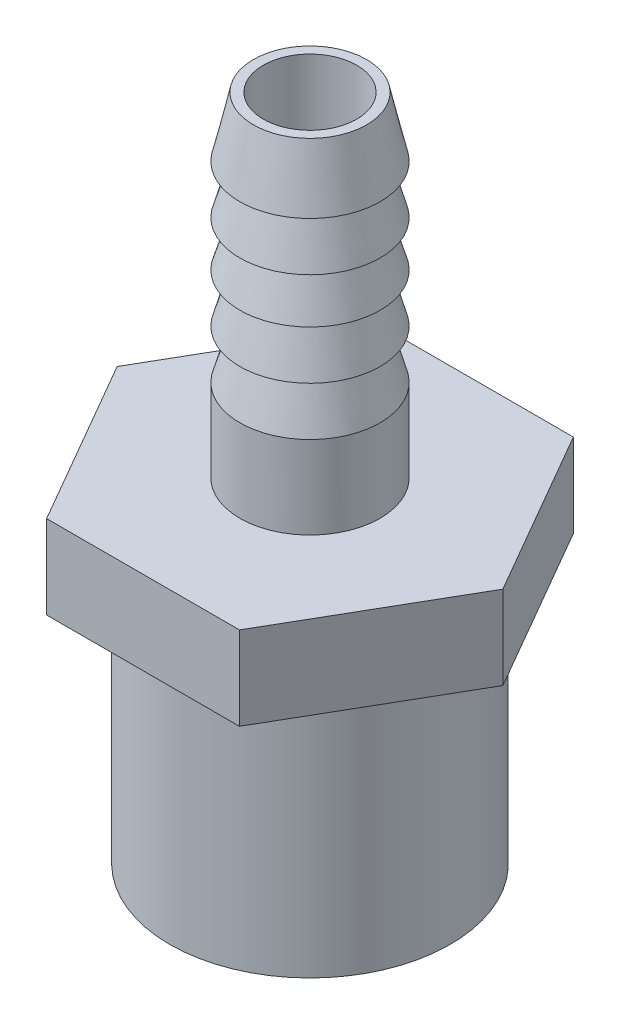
ISO-10303-21;
HEADER;
FILE_DESCRIPTION(('STEP AP214'),'2;1');
FILE_NAME('part.step','',(''),(''),'','','');
FILE_SCHEMA(('AUTOMOTIVE_DESIGN { 1 0 10303 214 1 1 1 1 }'));
ENDSEC;
DATA;
#1=APPLICATION_CONTEXT('core data for automotive mechanical design processes');
#2=APPLICATION_PROTOCOL_DEFINITION('international standard','automotive_design',2000,#1);
#3=PRODUCT_CONTEXT('',#1,'mechanical');
#4=PRODUCT('Part','Part','',(#3));
#5=PRODUCT_RELATED_PRODUCT_CATEGORY('part','',(#4));
#6=PRODUCT_DEFINITION_FORMATION('','',#4);
#7=PRODUCT_DEFINITION_CONTEXT('part definition',#1,'design');
#8=PRODUCT_DEFINITION('design','',#6,#7);
#9=PRODUCT_DEFINITION_SHAPE('','',#8);
#10=(LENGTH_UNIT() NAMED_UNIT(*) SI_UNIT(.MILLI.,.METRE.));
#11=(NAMED_UNIT(*) PLANE_ANGLE_UNIT() SI_UNIT($,.RADIAN.));
#12=(NAMED_UNIT(*) SI_UNIT($,.STERADIAN.) SOLID_ANGLE_UNIT());
#13=UNCERTAINTY_MEASURE_WITH_UNIT(LENGTH_MEASURE(1.E-05),#10,'distance_accuracy_value','');
#14=(GEOMETRIC_REPRESENTATION_CONTEXT(3) GLOBAL_UNCERTAINTY_ASSIGNED_CONTEXT((#13)) GLOBAL_UNIT_ASSIGNED_CONTEXT((#10,
#11,#12)) REPRESENTATION_CONTEXT('',''));
#15=CARTESIAN_POINT('',(0.,0.,0.));
#16=DIRECTION('',(0.,0.,1.));
#17=DIRECTION('',(1.,0.,0.));
#18=AXIS2_PLACEMENT_3D('',#15,#16,#17);
#19=CARTESIAN_POINT('',(-14.6646966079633,6.35,0.00259417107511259));
#20=DIRECTION('',(0.865936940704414,0.,-0.50015319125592));
#21=DIRECTION('',(-0.50015319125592,0.,-0.865936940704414));
#22=AXIS2_PLACEMENT_3D('',#19,#20,#21);
#23=PLANE('',#22);
#24=DIRECTION('',(0.50015319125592,0.,0.865936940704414));
#25=VECTOR('',#24,1.);
#26=CARTESIAN_POINT('',(-14.6646966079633,0.,0.00259417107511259));
#27=LINE('',#26,#25);
#28=CARTESIAN_POINT('',(-14.6646966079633,0.,0.00259417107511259));
#29=VERTEX_POINT('',#28);
#30=CARTESIAN_POINT('',(-7.33010168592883,0.,12.7012968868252));
#31=VERTEX_POINT('',#30);
#32=EDGE_CURVE('E119',#29,#31,#27,.T.);
#33=ORIENTED_EDGE('',*,*,#32,.T.);
#34=DIRECTION('',(0.,-1.,0.));
#35=VECTOR('',#34,1.);
#36=CARTESIAN_POINT('',(-7.33010168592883,6.35,12.7012968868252));
#37=LINE('',#36,#35);
#38=CARTESIAN_POINT('',(-7.33010168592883,6.35,12.7012968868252));
#39=VERTEX_POINT('',#38);
#40=EDGE_CURVE('E137',#39,#31,#37,.T.);
#41=ORIENTED_EDGE('',*,*,#40,.F.);
#42=DIRECTION('',(0.50015319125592,0.,0.865936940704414));
#43=VECTOR('',#42,1.);
#44=CARTESIAN_POINT('',(-14.6646966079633,6.35,0.00259417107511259));
#45=LINE('',#44,#43);
#46=CARTESIAN_POINT('',(-14.6646966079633,6.35,0.00259417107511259));
#47=VERTEX_POINT('',#46);
#48=EDGE_CURVE('E130',#47,#39,#45,.T.);
#49=ORIENTED_EDGE('',*,*,#48,.F.);
#50=DIRECTION('',(0.,-1.,0.));
#51=VECTOR('',#50,1.);
#52=CARTESIAN_POINT('',(-14.6646966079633,6.35,0.00259417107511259));
#53=LINE('',#52,#51);
#54=EDGE_CURVE('E115',#47,#29,#53,.T.);
#55=ORIENTED_EDGE('',*,*,#54,.T.);
#56=EDGE_LOOP('',(#33,#41,#49,#55));
#57=FACE_BOUND('',#56,.T.);
#58=ADVANCED_FACE('F34',(#57),#23,.F.);
#59=CARTESIAN_POINT('',(-7.33010168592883,6.35,12.7012968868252));
#60=DIRECTION('',(-0.000176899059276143,0.,-0.999999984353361));
#61=DIRECTION('',(-0.999999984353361,0.,0.000176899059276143));
#62=AXIS2_PLACEMENT_3D('',#59,#60,#61);
#63=PLANE('',#62);
#64=DIRECTION('',(0.999999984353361,0.,-0.000176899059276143));
#65=VECTOR('',#64,1.);
#66=CARTESIAN_POINT('',(-7.33010168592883,0.,12.7012968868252));
#67=LINE('',#66,#65);
#68=CARTESIAN_POINT('',(7.33459492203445,0.,12.6987027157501));
#69=VERTEX_POINT('',#68);
#70=EDGE_CURVE('E122',#31,#69,#67,.T.);
#71=ORIENTED_EDGE('',*,*,#70,.T.);
#72=DIRECTION('',(0.,-1.,0.));
#73=VECTOR('',#72,1.);
#74=CARTESIAN_POINT('',(7.33459492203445,6.35,12.6987027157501));
#75=LINE('',#74,#73);
#76=CARTESIAN_POINT('',(7.33459492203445,6.35,12.6987027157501));
#77=VERTEX_POINT('',#76);
#78=EDGE_CURVE('E134',#77,#69,#75,.T.);
#79=ORIENTED_EDGE('',*,*,#78,.F.);
#80=DIRECTION('',(0.999999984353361,0.,-0.000176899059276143));
#81=VECTOR('',#80,1.);
#82=CARTESIAN_POINT('',(-7.33010168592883,6.35,12.7012968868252));
#83=LINE('',#82,#81);
#84=EDGE_CURVE('E88',#39,#77,#83,.T.);
#85=ORIENTED_EDGE('',*,*,#84,.F.);
#86=ORIENTED_EDGE('',*,*,#40,.T.);
#87=EDGE_LOOP('',(#71,#79,#85,#86));
#88=FACE_BOUND('',#87,.T.);
#89=ADVANCED_FACE('F169',(#88),#63,.F.);
#90=CARTESIAN_POINT('',(7.33459492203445,6.35,12.6987027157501));
#91=DIRECTION('',(-0.86611383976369,0.,-0.499846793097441));
#92=DIRECTION('',(-0.499846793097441,0.,0.866113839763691));
#93=AXIS2_PLACEMENT_3D('',#90,#91,#92);
#94=PLANE('',#93);
#95=DIRECTION('',(0.499846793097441,0.,-0.86611383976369));
#96=VECTOR('',#95,1.);
#97=CARTESIAN_POINT('',(7.33459492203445,0.,12.6987027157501));
#98=LINE('',#97,#96);
#99=CARTESIAN_POINT('',(14.6646966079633,0.,-0.00259417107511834));
#100=VERTEX_POINT('',#99);
#101=EDGE_CURVE('E125',#69,#100,#98,.T.);
#102=ORIENTED_EDGE('',*,*,#101,.T.);
#103=DIRECTION('',(0.,-1.,0.));
#104=VECTOR('',#103,1.);
#105=CARTESIAN_POINT('',(14.6646966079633,6.35,-0.00259417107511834));
#106=LINE('',#105,#104);
#107=CARTESIAN_POINT('',(14.6646966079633,6.35,-0.00259417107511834));
#108=VERTEX_POINT('',#107);
#109=EDGE_CURVE('E110',#108,#100,#106,.T.);
#110=ORIENTED_EDGE('',*,*,#109,.F.);
#111=DIRECTION('',(0.499846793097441,0.,-0.86611383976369));
#112=VECTOR('',#111,1.);
#113=CARTESIAN_POINT('',(7.33459492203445,6.35,12.6987027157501));
#114=LINE('',#113,#112);
#115=EDGE_CURVE('E101',#77,#108,#114,.T.);
#116=ORIENTED_EDGE('',*,*,#115,.F.);
#117=ORIENTED_EDGE('',*,*,#78,.T.);
#118=EDGE_LOOP('',(#102,#110,#116,#117));
#119=FACE_BOUND('',#118,.T.);
#120=ADVANCED_FACE('F174',(#119),#94,.F.);
#121=CARTESIAN_POINT('',(14.6646966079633,6.35,-0.00259417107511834));
#122=DIRECTION('',(-0.865936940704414,0.,0.50015319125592));
#123=DIRECTION('',(0.50015319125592,0.,0.865936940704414));
#124=AXIS2_PLACEMENT_3D('',#121,#122,#123);
#125=PLANE('',#124);
#126=DIRECTION('',(-0.50015319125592,0.,-0.865936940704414));
#127=VECTOR('',#126,1.);
#128=CARTESIAN_POINT('',(14.6646966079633,0.,-0.00259417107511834));
#129=LINE('',#128,#127);
#130=CARTESIAN_POINT('',(7.33010168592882,0.,-12.7012968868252));
#131=VERTEX_POINT('',#130);
#132=EDGE_CURVE('E109',#100,#131,#129,.T.);
#133=ORIENTED_EDGE('',*,*,#132,.T.);
#134=DIRECTION('',(0.,-1.,0.));
#135=VECTOR('',#134,1.);
#136=CARTESIAN_POINT('',(7.33010168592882,6.35,-12.7012968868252));
#137=LINE('',#136,#135);
#138=CARTESIAN_POINT('',(7.33010168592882,6.35,-12.7012968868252));
#139=VERTEX_POINT('',#138);
#140=EDGE_CURVE('E106',#139,#131,#137,.T.);
#141=ORIENTED_EDGE('',*,*,#140,.F.);
#142=DIRECTION('',(-0.50015319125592,0.,-0.865936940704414));
#143=VECTOR('',#142,1.);
#144=CARTESIAN_POINT('',(14.6646966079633,6.35,-0.00259417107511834));
#145=LINE('',#144,#143);
#146=EDGE_CURVE('E95',#108,#139,#145,.T.);
#147=ORIENTED_EDGE('',*,*,#146,.F.);
#148=ORIENTED_EDGE('',*,*,#109,.T.);
#149=EDGE_LOOP('',(#133,#141,#147,#148));
#150=FACE_BOUND('',#149,.T.);
#151=ADVANCED_FACE('F107',(#150),#125,.F.);
#152=CARTESIAN_POINT('',(7.33010168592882,6.35,-12.7012968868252));
#153=DIRECTION('',(0.000176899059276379,0.,0.999999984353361));
#154=DIRECTION('',(0.999999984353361,0.,-0.000176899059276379));
#155=AXIS2_PLACEMENT_3D('',#152,#153,#154);
#156=PLANE('',#155);
#157=DIRECTION('',(-0.999999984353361,0.,0.000176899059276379));
#158=VECTOR('',#157,1.);
#159=CARTESIAN_POINT('',(7.33010168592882,0.,-12.7012968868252));
#160=LINE('',#159,#158);
#161=CARTESIAN_POINT('',(-7.33459492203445,0.,-12.6987027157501));
#162=VERTEX_POINT('',#161);
#163=EDGE_CURVE('E73',#131,#162,#160,.T.);
#164=ORIENTED_EDGE('',*,*,#163,.T.);
#165=DIRECTION('',(0.,-1.,0.));
#166=VECTOR('',#165,1.);
#167=CARTESIAN_POINT('',(-7.33459492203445,6.35,-12.6987027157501));
#168=LINE('',#167,#166);
#169=CARTESIAN_POINT('',(-7.33459492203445,6.35,-12.6987027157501));
#170=VERTEX_POINT('',#169);
#171=EDGE_CURVE('E111',#170,#162,#168,.T.);
#172=ORIENTED_EDGE('',*,*,#171,.F.);
#173=DIRECTION('',(-0.999999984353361,0.,0.000176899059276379));
#174=VECTOR('',#173,1.);
#175=CARTESIAN_POINT('',(7.33010168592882,6.35,-12.7012968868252));
#176=LINE('',#175,#174);
#177=EDGE_CURVE('E99',#139,#170,#176,.T.);
#178=ORIENTED_EDGE('',*,*,#177,.F.);
#179=ORIENTED_EDGE('',*,*,#140,.T.);
#180=EDGE_LOOP('',(#164,#172,#178,#179));
#181=FACE_BOUND('',#180,.T.);
#182=ADVANCED_FACE('F113',(#181),#156,.F.);
#183=CARTESIAN_POINT('',(-7.33459492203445,6.35,-12.6987027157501));
#184=DIRECTION('',(0.86611383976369,0.,0.499846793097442));
#185=DIRECTION('',(0.499846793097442,0.,-0.86611383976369));
#186=AXIS2_PLACEMENT_3D('',#183,#184,#185);
#187=PLANE('',#186);
#188=DIRECTION('',(-0.499846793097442,0.,0.86611383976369));
#189=VECTOR('',#188,1.);
#190=CARTESIAN_POINT('',(-7.33459492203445,0.,-12.6987027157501));
#191=LINE('',#190,#189);
#192=EDGE_CURVE('E79',#162,#29,#191,.T.);
#193=ORIENTED_EDGE('',*,*,#192,.T.);
#194=ORIENTED_EDGE('',*,*,#54,.F.);
#195=DIRECTION('',(-0.499846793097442,0.,0.86611383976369));
#196=VECTOR('',#195,1.);
#197=CARTESIAN_POINT('',(-7.33459492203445,6.35,-12.6987027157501));
#198=LINE('',#197,#196);
#199=EDGE_CURVE('E50',#170,#47,#198,.T.);
#200=ORIENTED_EDGE('',*,*,#199,.F.);
#201=ORIENTED_EDGE('',*,*,#171,.T.);
#202=EDGE_LOOP('',(#193,#194,#200,#201));
#203=FACE_BOUND('',#202,.T.);
#204=ADVANCED_FACE('F166',(#203),#187,.F.);
#205=CARTESIAN_POINT('',(0.,6.35,0.));
#206=DIRECTION('',(0.,1.,0.));
#207=DIRECTION('',(0.,0.,1.));
#208=AXIS2_PLACEMENT_3D('',#205,#206,#207);
#209=PLANE('',#208);
#210=CARTESIAN_POINT('',(0.,6.35,0.));
#211=DIRECTION('',(0.,1.,0.));
#212=DIRECTION('',(0.,0.,1.));
#213=AXIS2_PLACEMENT_3D('',#210,#211,#212);
#214=CIRCLE('',#213,5.334);
#215=CARTESIAN_POINT('',(0.,6.35,5.334));
#216=VERTEX_POINT('',#215);
#217=EDGE_CURVE('E139',#216,#216,#214,.T.);
#218=ORIENTED_EDGE('',*,*,#217,.F.);
#219=EDGE_LOOP('',(#218));
#220=FACE_BOUND('',#219,.T.);
#221=ORIENTED_EDGE('',*,*,#48,.T.);
#222=ORIENTED_EDGE('',*,*,#84,.T.);
#223=ORIENTED_EDGE('',*,*,#115,.T.);
#224=ORIENTED_EDGE('',*,*,#146,.T.);
#225=ORIENTED_EDGE('',*,*,#177,.T.);
#226=ORIENTED_EDGE('',*,*,#199,.T.);
#227=EDGE_LOOP('',(#221,#222,#223,#224,#225,#226));
#228=FACE_BOUND('',#227,.T.);
#229=ADVANCED_FACE('F97',(#220,#228),#209,.T.);
#230=CARTESIAN_POINT('',(0.,0.,0.));
#231=DIRECTION('',(0.,1.,0.));
#232=DIRECTION('',(0.,0.,1.));
#233=AXIS2_PLACEMENT_3D('',#230,#231,#232);
#234=PLANE('',#233);
#235=CARTESIAN_POINT('',(0.,0.,0.));
#236=DIRECTION('',(0.,1.,0.));
#237=DIRECTION('',(0.,0.,1.));
#238=AXIS2_PLACEMENT_3D('',#235,#236,#237);
#239=CIRCLE('',#238,10.668);
#240=CARTESIAN_POINT('',(0.,0.,10.668));
#241=VERTEX_POINT('',#240);
#242=EDGE_CURVE('E11',#241,#241,#239,.F.);
#243=ORIENTED_EDGE('',*,*,#242,.F.);
#244=EDGE_LOOP('',(#243));
#245=FACE_BOUND('',#244,.T.);
#246=ORIENTED_EDGE('',*,*,#32,.F.);
#247=ORIENTED_EDGE('',*,*,#192,.F.);
#248=ORIENTED_EDGE('',*,*,#163,.F.);
#249=ORIENTED_EDGE('',*,*,#132,.F.);
#250=ORIENTED_EDGE('',*,*,#101,.F.);
#251=ORIENTED_EDGE('',*,*,#70,.F.);
#252=EDGE_LOOP('',(#246,#247,#248,#249,#250,#251));
#253=FACE_BOUND('',#252,.T.);
#254=ADVANCED_FACE('F165',(#245,#253),#234,.F.);
#255=CARTESIAN_POINT('',(0.,-18.5582568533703,0.));
#256=DIRECTION('',(0.,-1.,0.));
#257=DIRECTION('',(0.,0.,-1.));
#258=AXIS2_PLACEMENT_3D('',#255,#256,#257);
#259=CYLINDRICAL_SURFACE('',#258,3.556);
#260=CARTESIAN_POINT('',(0.,6.35,0.));
#261=DIRECTION('',(0.,1.,0.));
#262=DIRECTION('',(0.,0.,1.));
#263=AXIS2_PLACEMENT_3D('',#260,#261,#262);
#264=CIRCLE('',#263,3.556);
#265=CARTESIAN_POINT('',(0.,6.35,3.556));
#266=VERTEX_POINT('',#265);
#267=EDGE_CURVE('E42',#266,#266,#264,.F.);
#268=ORIENTED_EDGE('',*,*,#267,.T.);
#269=EDGE_LOOP('',(#268));
#270=FACE_BOUND('',#269,.T.);
#271=CARTESIAN_POINT('',(0.,31.75,0.));
#272=DIRECTION('',(0.,-1.,0.));
#273=DIRECTION('',(0.,0.,-1.));
#274=AXIS2_PLACEMENT_3D('',#271,#272,#273);
#275=CIRCLE('',#274,3.556);
#276=CARTESIAN_POINT('',(0.,31.75,-3.556));
#277=VERTEX_POINT('',#276);
#278=EDGE_CURVE('E123',#277,#277,#275,.T.);
#279=ORIENTED_EDGE('',*,*,#278,.F.);
#280=EDGE_LOOP('',(#279));
#281=FACE_BOUND('',#280,.T.);
#282=ADVANCED_FACE('F144',(#270,#281),#259,.F.);
#283=CARTESIAN_POINT('',(3.556,31.75,0.));
#284=DIRECTION('',(0.,1.,0.));
#285=DIRECTION('',(0.,0.,1.));
#286=AXIS2_PLACEMENT_3D('',#283,#284,#285);
#287=PLANE('',#286);
#288=ORIENTED_EDGE('',*,*,#278,.T.);
#289=EDGE_LOOP('',(#288));
#290=FACE_BOUND('',#289,.T.);
#291=CARTESIAN_POINT('',(0.,31.75,0.));
#292=DIRECTION('',(0.,-1.,0.));
#293=DIRECTION('',(0.,0.,-1.));
#294=AXIS2_PLACEMENT_3D('',#291,#292,#293);
#295=CIRCLE('',#294,4.30606324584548);
#296=CARTESIAN_POINT('',(0.,31.75,-4.30606324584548));
#297=VERTEX_POINT('',#296);
#298=EDGE_CURVE('E186',#297,#297,#295,.T.);
#299=ORIENTED_EDGE('',*,*,#298,.F.);
#300=EDGE_LOOP('',(#299));
#301=FACE_BOUND('',#300,.T.);
#302=ADVANCED_FACE('F243',(#290,#301),#287,.T.);
#303=CARTESIAN_POINT('',(0.,27.1995883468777,0.));
#304=DIRECTION('',(0.,-1.,0.));
#305=DIRECTION('',(0.,0.,-1.));
#306=AXIS2_PLACEMENT_3D('',#303,#304,#305);
#307=CONICAL_SURFACE('',#306,5.334,0.222170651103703);
#308=ORIENTED_EDGE('',*,*,#298,.T.);
#309=EDGE_LOOP('',(#308));
#310=FACE_BOUND('',#309,.T.);
#311=CARTESIAN_POINT('',(0.,27.1995883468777,0.));
#312=DIRECTION('',(0.,-1.,0.));
#313=DIRECTION('',(0.,0.,-1.));
#314=AXIS2_PLACEMENT_3D('',#311,#312,#313);
#315=CIRCLE('',#314,5.334);
#316=CARTESIAN_POINT('',(0.,27.1995883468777,-5.334));
#317=VERTEX_POINT('',#316);
#318=EDGE_CURVE('E189',#317,#317,#315,.T.);
#319=ORIENTED_EDGE('',*,*,#318,.F.);
#320=EDGE_LOOP('',(#319));
#321=FACE_BOUND('',#320,.T.);
#322=ADVANCED_FACE('F283',(#310,#321),#307,.T.);
#323=CARTESIAN_POINT('',(5.334,27.1995883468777,0.));
#324=DIRECTION('',(0.,-1.,0.));
#325=DIRECTION('',(0.,0.,-1.));
#326=AXIS2_PLACEMENT_3D('',#323,#324,#325);
#327=PLANE('',#326);
#328=ORIENTED_EDGE('',*,*,#318,.T.);
#329=EDGE_LOOP('',(#328));
#330=FACE_BOUND('',#329,.T.);
#331=CARTESIAN_POINT('',(0.,27.1995883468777,0.));
#332=DIRECTION('',(0.,-1.,0.));
#333=DIRECTION('',(0.,0.,-1.));
#334=AXIS2_PLACEMENT_3D('',#331,#332,#333);
#335=CIRCLE('',#334,4.30606324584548);
#336=CARTESIAN_POINT('',(0.,27.1995883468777,-4.30606324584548));
#337=VERTEX_POINT('',#336);
#338=EDGE_CURVE('E192',#337,#337,#335,.T.);
#339=ORIENTED_EDGE('',*,*,#338,.F.);
#340=EDGE_LOOP('',(#339));
#341=FACE_BOUND('',#340,.T.);
#342=ADVANCED_FACE('F279',(#330,#341),#327,.T.);
#343=CARTESIAN_POINT('',(0.,23.4944864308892,0.));
#344=DIRECTION('',(0.,-1.,0.));
#345=DIRECTION('',(0.,0.,-1.));
#346=AXIS2_PLACEMENT_3D('',#343,#344,#345);
#347=CONICAL_SURFACE('',#346,5.334,0.270631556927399);
#348=ORIENTED_EDGE('',*,*,#338,.T.);
#349=EDGE_LOOP('',(#348));
#350=FACE_BOUND('',#349,.T.);
#351=CARTESIAN_POINT('',(0.,23.4944864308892,0.));
#352=DIRECTION('',(0.,-1.,0.));
#353=DIRECTION('',(0.,0.,-1.));
#354=AXIS2_PLACEMENT_3D('',#351,#352,#353);
#355=CIRCLE('',#354,5.334);
#356=CARTESIAN_POINT('',(0.,23.4944864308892,-5.334));
#357=VERTEX_POINT('',#356);
#358=EDGE_CURVE('E195',#357,#357,#355,.T.);
#359=ORIENTED_EDGE('',*,*,#358,.F.);
#360=EDGE_LOOP('',(#359));
#361=FACE_BOUND('',#360,.T.);
#362=ADVANCED_FACE('F275',(#350,#361),#347,.T.);
#363=CARTESIAN_POINT('',(5.334,23.4944864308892,0.));
#364=DIRECTION('',(0.,-1.,0.));
#365=DIRECTION('',(0.,0.,-1.));
#366=AXIS2_PLACEMENT_3D('',#363,#364,#365);
#367=PLANE('',#366);
#368=ORIENTED_EDGE('',*,*,#358,.T.);
#369=EDGE_LOOP('',(#368));
#370=FACE_BOUND('',#369,.T.);
#371=CARTESIAN_POINT('',(0.,23.4944864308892,0.));
#372=DIRECTION('',(0.,-1.,0.));
#373=DIRECTION('',(0.,0.,-1.));
#374=AXIS2_PLACEMENT_3D('',#371,#372,#373);
#375=CIRCLE('',#374,4.30606324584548);
#376=CARTESIAN_POINT('',(0.,23.4944864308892,-4.30606324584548));
#377=VERTEX_POINT('',#376);
#378=EDGE_CURVE('E198',#377,#377,#375,.T.);
#379=ORIENTED_EDGE('',*,*,#378,.F.);
#380=EDGE_LOOP('',(#379));
#381=FACE_BOUND('',#380,.T.);
#382=ADVANCED_FACE('F271',(#370,#381),#367,.T.);
#383=CARTESIAN_POINT('',(0.,20.0509211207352,0.));
#384=DIRECTION('',(0.,-1.,0.));
#385=DIRECTION('',(0.,0.,-1.));
#386=AXIS2_PLACEMENT_3D('',#383,#384,#385);
#387=CONICAL_SURFACE('',#386,5.334,0.29008874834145);
#388=ORIENTED_EDGE('',*,*,#378,.T.);
#389=EDGE_LOOP('',(#388));
#390=FACE_BOUND('',#389,.T.);
#391=CARTESIAN_POINT('',(0.,20.0509211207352,0.));
#392=DIRECTION('',(0.,-1.,0.));
#393=DIRECTION('',(0.,0.,-1.));
#394=AXIS2_PLACEMENT_3D('',#391,#392,#393);
#395=CIRCLE('',#394,5.334);
#396=CARTESIAN_POINT('',(0.,20.0509211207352,-5.334));
#397=VERTEX_POINT('',#396);
#398=EDGE_CURVE('E201',#397,#397,#395,.T.);
#399=ORIENTED_EDGE('',*,*,#398,.F.);
#400=EDGE_LOOP('',(#399));
#401=FACE_BOUND('',#400,.T.);
#402=ADVANCED_FACE('F267',(#390,#401),#387,.T.);
#403=CARTESIAN_POINT('',(5.334,20.0509211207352,0.));
#404=DIRECTION('',(0.,-1.,0.));
#405=DIRECTION('',(0.,0.,-1.));
#406=AXIS2_PLACEMENT_3D('',#403,#404,#405);
#407=PLANE('',#406);
#408=ORIENTED_EDGE('',*,*,#398,.T.);
#409=EDGE_LOOP('',(#408));
#410=FACE_BOUND('',#409,.T.);
#411=CARTESIAN_POINT('',(0.,20.0509211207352,0.));
#412=DIRECTION('',(0.,-1.,0.));
#413=DIRECTION('',(0.,0.,-1.));
#414=AXIS2_PLACEMENT_3D('',#411,#412,#413);
#415=CIRCLE('',#414,4.30606324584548);
#416=CARTESIAN_POINT('',(0.,20.0509211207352,-4.30606324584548));
#417=VERTEX_POINT('',#416);
#418=EDGE_CURVE('E204',#417,#417,#415,.T.);
#419=ORIENTED_EDGE('',*,*,#418,.F.);
#420=EDGE_LOOP('',(#419));
#421=FACE_BOUND('',#420,.T.);
#422=ADVANCED_FACE('F263',(#410,#421),#407,.T.);
#423=CARTESIAN_POINT('',(0.,16.3458192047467,0.));
#424=DIRECTION('',(0.,-1.,0.));
#425=DIRECTION('',(0.,0.,-1.));
#426=AXIS2_PLACEMENT_3D('',#423,#424,#425);
#427=CONICAL_SURFACE('',#426,5.334,0.270631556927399);
#428=ORIENTED_EDGE('',*,*,#418,.T.);
#429=EDGE_LOOP('',(#428));
#430=FACE_BOUND('',#429,.T.);
#431=CARTESIAN_POINT('',(0.,16.3458192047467,0.));
#432=DIRECTION('',(0.,-1.,0.));
#433=DIRECTION('',(0.,0.,-1.));
#434=AXIS2_PLACEMENT_3D('',#431,#432,#433);
#435=CIRCLE('',#434,5.334);
#436=CARTESIAN_POINT('',(0.,16.3458192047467,-5.334));
#437=VERTEX_POINT('',#436);
#438=EDGE_CURVE('E207',#437,#437,#435,.T.);
#439=ORIENTED_EDGE('',*,*,#438,.F.);
#440=EDGE_LOOP('',(#439));
#441=FACE_BOUND('',#440,.T.);
#442=ADVANCED_FACE('F259',(#430,#441),#427,.T.);
#443=CARTESIAN_POINT('',(5.334,16.3458192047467,0.));
#444=DIRECTION('',(0.,-1.,0.));
#445=DIRECTION('',(0.,0.,-1.));
#446=AXIS2_PLACEMENT_3D('',#443,#444,#445);
#447=PLANE('',#446);
#448=ORIENTED_EDGE('',*,*,#438,.T.);
#449=EDGE_LOOP('',(#448));
#450=FACE_BOUND('',#449,.T.);
#451=CARTESIAN_POINT('',(0.,16.3458192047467,0.));
#452=DIRECTION('',(0.,-1.,0.));
#453=DIRECTION('',(0.,0.,-1.));
#454=AXIS2_PLACEMENT_3D('',#451,#452,#453);
#455=CIRCLE('',#454,4.30606324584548);
#456=CARTESIAN_POINT('',(0.,16.3458192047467,-4.30606324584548));
#457=VERTEX_POINT('',#456);
#458=EDGE_CURVE('E210',#457,#457,#455,.T.);
#459=ORIENTED_EDGE('',*,*,#458,.F.);
#460=EDGE_LOOP('',(#459));
#461=FACE_BOUND('',#460,.T.);
#462=ADVANCED_FACE('F255',(#450,#461),#447,.T.);
#463=CARTESIAN_POINT('',(0.,12.6407172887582,0.));
#464=DIRECTION('',(0.,-1.,0.));
#465=DIRECTION('',(0.,0.,-1.));
#466=AXIS2_PLACEMENT_3D('',#463,#464,#465);
#467=CONICAL_SURFACE('',#466,5.334,0.270631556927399);
#468=ORIENTED_EDGE('',*,*,#458,.T.);
#469=EDGE_LOOP('',(#468));
#470=FACE_BOUND('',#469,.T.);
#471=CARTESIAN_POINT('',(0.,12.6407172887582,0.));
#472=DIRECTION('',(0.,-1.,0.));
#473=DIRECTION('',(0.,0.,-1.));
#474=AXIS2_PLACEMENT_3D('',#471,#472,#473);
#475=CIRCLE('',#474,5.334);
#476=CARTESIAN_POINT('',(0.,12.6407172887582,-5.334));
#477=VERTEX_POINT('',#476);
#478=EDGE_CURVE('E213',#477,#477,#475,.T.);
#479=ORIENTED_EDGE('',*,*,#478,.F.);
#480=EDGE_LOOP('',(#479));
#481=FACE_BOUND('',#480,.T.);
#482=ADVANCED_FACE('F159',(#470,#481),#467,.T.);
#483=CARTESIAN_POINT('',(0.,-18.5582568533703,0.));
#484=DIRECTION('',(0.,-1.,0.));
#485=DIRECTION('',(0.,0.,-1.));
#486=AXIS2_PLACEMENT_3D('',#483,#484,#485);
#487=CYLINDRICAL_SURFACE('',#486,5.334);
#488=ORIENTED_EDGE('',*,*,#478,.T.);
#489=EDGE_LOOP('',(#488));
#490=FACE_BOUND('',#489,.T.);
#491=ORIENTED_EDGE('',*,*,#217,.T.);
#492=EDGE_LOOP('',(#491));
#493=FACE_BOUND('',#492,.T.);
#494=ADVANCED_FACE('F150',(#490,#493),#487,.T.);
#495=ORIENTED_EDGE('',*,*,#267,.F.);
#496=EDGE_LOOP('',(#495));
#497=FACE_BOUND('',#496,.T.);
#498=ADVANCED_FACE('F147',(#497),#209,.T.);
#499=CARTESIAN_POINT('',(0.,-19.05,0.));
#500=DIRECTION('',(0.,-1.,0.));
#501=DIRECTION('',(0.,0.,-1.));
#502=AXIS2_PLACEMENT_3D('',#499,#500,#501);
#503=PLANE('',#502);
#504=CARTESIAN_POINT('',(0.,-19.05,0.));
#505=DIRECTION('',(0.,-1.,0.));
#506=DIRECTION('',(0.,0.,-1.));
#507=AXIS2_PLACEMENT_3D('',#504,#505,#506);
#508=CIRCLE('',#507,10.668);
#509=CARTESIAN_POINT('',(0.,-19.05,10.668));
#510=VERTEX_POINT('',#509);
#511=EDGE_CURVE('E216',#510,#510,#508,.T.);
#512=ORIENTED_EDGE('',*,*,#511,.T.);
#513=EDGE_LOOP('',(#512));
#514=FACE_BOUND('',#513,.T.);
#515=CARTESIAN_POINT('',(0.,-19.05,0.));
#516=DIRECTION('',(0.,-1.,0.));
#517=DIRECTION('',(0.,0.,-1.));
#518=AXIS2_PLACEMENT_3D('',#515,#516,#517);
#519=CIRCLE('',#518,7.8994);
#520=CARTESIAN_POINT('',(0.,-19.05,7.8994));
#521=VERTEX_POINT('',#520);
#522=EDGE_CURVE('E219',#521,#521,#519,.T.);
#523=ORIENTED_EDGE('',*,*,#522,.F.);
#524=EDGE_LOOP('',(#523));
#525=FACE_BOUND('',#524,.T.);
#526=ADVANCED_FACE('F149',(#514,#525),#503,.T.);
#527=CARTESIAN_POINT('',(0.,-19.05,0.));
#528=DIRECTION('',(0.,1.,0.));
#529=DIRECTION('',(0.,0.,1.));
#530=AXIS2_PLACEMENT_3D('',#527,#528,#529);
#531=CYLINDRICAL_SURFACE('',#530,10.668);
#532=CARTESIAN_POINT('',(0.,-19.05,10.668));
#533=CARTESIAN_POINT('',(0.,-18.8515625,10.668));
#534=CARTESIAN_POINT('',(0.,-18.653125,10.668));
#535=CARTESIAN_POINT('',(0.,-18.25625,10.668));
#536=CARTESIAN_POINT('',(0.,-18.0578125,10.668));
#537=CARTESIAN_POINT('',(0.,-17.6609375,10.668));
#538=CARTESIAN_POINT('',(0.,-17.4625,10.668));
#539=CARTESIAN_POINT('',(0.,-17.065625,10.668));
#540=CARTESIAN_POINT('',(0.,-16.8671875,10.668));
#541=CARTESIAN_POINT('',(0.,-16.4703125,10.668));
#542=CARTESIAN_POINT('',(0.,-16.271875,10.668));
#543=CARTESIAN_POINT('',(0.,-15.875,10.668));
#544=CARTESIAN_POINT('',(0.,-15.6765625,10.668));
#545=CARTESIAN_POINT('',(0.,-15.2796875,10.668));
#546=CARTESIAN_POINT('',(0.,-15.08125,10.668));
#547=CARTESIAN_POINT('',(0.,-14.684375,10.668));
#548=CARTESIAN_POINT('',(0.,-14.4859375,10.668));
#549=CARTESIAN_POINT('',(0.,-14.0890625,10.668));
#550=CARTESIAN_POINT('',(0.,-13.890625,10.668));
#551=CARTESIAN_POINT('',(0.,-13.49375,10.668));
#552=CARTESIAN_POINT('',(0.,-13.2953125,10.668));
#553=CARTESIAN_POINT('',(0.,-12.8984375,10.668));
#554=CARTESIAN_POINT('',(0.,-12.7,10.668));
#555=CARTESIAN_POINT('',(0.,-12.303125,10.668));
#556=CARTESIAN_POINT('',(0.,-12.1046875,10.668));
#557=CARTESIAN_POINT('',(0.,-11.7078125,10.668));
#558=CARTESIAN_POINT('',(0.,-11.509375,10.668));
#559=CARTESIAN_POINT('',(0.,-11.1125,10.668));
#560=CARTESIAN_POINT('',(0.,-10.9140625,10.668));
#561=CARTESIAN_POINT('',(0.,-10.5171875,10.668));
#562=CARTESIAN_POINT('',(0.,-10.31875,10.668));
#563=CARTESIAN_POINT('',(0.,-9.921875,10.668));
#564=CARTESIAN_POINT('',(0.,-9.7234375,10.668));
#565=CARTESIAN_POINT('',(0.,-9.3265625,10.668));
#566=CARTESIAN_POINT('',(0.,-9.128125,10.668));
#567=CARTESIAN_POINT('',(0.,-8.73125,10.668));
#568=CARTESIAN_POINT('',(0.,-8.5328125,10.668));
#569=CARTESIAN_POINT('',(0.,-8.1359375,10.668));
#570=CARTESIAN_POINT('',(0.,-7.9375,10.668));
#571=CARTESIAN_POINT('',(0.,-7.540625,10.668));
#572=CARTESIAN_POINT('',(0.,-7.3421875,10.668));
#573=CARTESIAN_POINT('',(0.,-6.9453125,10.668));
#574=CARTESIAN_POINT('',(0.,-6.746875,10.668));
#575=CARTESIAN_POINT('',(0.,-6.35,10.668));
#576=CARTESIAN_POINT('',(0.,-6.1515625,10.668));
#577=CARTESIAN_POINT('',(0.,-5.7546875,10.668));
#578=CARTESIAN_POINT('',(0.,-5.55625,10.668));
#579=CARTESIAN_POINT('',(0.,-5.159375,10.668));
#580=CARTESIAN_POINT('',(0.,-4.9609375,10.668));
#581=CARTESIAN_POINT('',(0.,-4.5640625,10.668));
#582=CARTESIAN_POINT('',(0.,-4.365625,10.668));
#583=CARTESIAN_POINT('',(0.,-3.96875,10.668));
#584=CARTESIAN_POINT('',(0.,-3.7703125,10.668));
#585=CARTESIAN_POINT('',(0.,-3.3734375,10.668));
#586=CARTESIAN_POINT('',(0.,-3.175,10.668));
#587=CARTESIAN_POINT('',(0.,-2.778125,10.668));
#588=CARTESIAN_POINT('',(0.,-2.5796875,10.668));
#589=CARTESIAN_POINT('',(0.,-2.1828125,10.668));
#590=CARTESIAN_POINT('',(0.,-1.984375,10.668));
#591=CARTESIAN_POINT('',(0.,-1.5875,10.668));
#592=CARTESIAN_POINT('',(0.,-1.3890625,10.668));
#593=CARTESIAN_POINT('',(0.,-0.992187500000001,10.668));
#594=CARTESIAN_POINT('',(0.,-0.793750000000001,10.668));
#595=CARTESIAN_POINT('',(0.,-0.396875,10.668));
#596=CARTESIAN_POINT('',(0.,-0.1984375,10.668));
#597=CARTESIAN_POINT('',(0.,0.,10.668));
#598=B_SPLINE_CURVE_WITH_KNOTS('',3,(#532,#533,#534,#535,#536,#537,#538,#539,#540,#541,#542,
#543,#544,#545,#546,#547,#548,#549,#550,#551,#552,#553,#554,#555,#556,#557,#558,#559,#560,#561,
#562,#563,#564,#565,#566,#567,#568,#569,#570,#571,#572,#573,#574,#575,#576,#577,#578,#579,#580,
#581,#582,#583,#584,#585,#586,#587,#588,#589,#590,#591,#592,#593,#594,#595,#596,#597),
.UNSPECIFIED.,.F.,.F.,(4,2,2,2,2,2,2,2,2,2,2,2,2,2,2,2,2,2,2,2,2,2,2,2,2,2,2,2,2,2,2,2,4),(0.,
0.5953125,1.190625,1.7859375,2.38125,2.9765625,3.571875,4.1671875,4.7625,5.3578125,5.953125,
6.5484375,7.14375,7.7390625,8.334375,8.9296875,9.525,10.1203125,10.715625,11.3109375,11.90625,
12.5015625,13.096875,13.6921875,14.2875,14.8828125,15.478125,16.0734375,16.66875,17.2640625,
17.859375,18.4546875,19.05),.UNSPECIFIED.);
#599=EDGE_CURVE('BSEAM156',#510,#241,#598,.T.);
#600=ORIENTED_EDGE('',*,*,#511,.F.);
#601=ORIENTED_EDGE('',*,*,#242,.T.);
#602=ORIENTED_EDGE('',*,*,#599,.T.);
#603=ORIENTED_EDGE('',*,*,#599,.F.);
#604=EDGE_LOOP('',(#600,#602,#601,#603));
#605=FACE_BOUND('',#604,.T.);
#606=ADVANCED_FACE('F156',(#605),#531,.T.);
#607=CARTESIAN_POINT('',(0.,-19.05,0.));
#608=DIRECTION('',(0.,1.,0.));
#609=DIRECTION('',(0.,0.,1.));
#610=AXIS2_PLACEMENT_3D('',#607,#608,#609);
#611=CYLINDRICAL_SURFACE('',#610,7.8994);
#612=CARTESIAN_POINT('',(0.,0.,0.));
#613=DIRECTION('',(0.,-1.,0.));
#614=DIRECTION('',(0.,0.,-1.));
#615=AXIS2_PLACEMENT_3D('',#612,#613,#614);
#616=CIRCLE('',#615,7.8994);
#617=CARTESIAN_POINT('',(0.,0.,7.8994));
#618=VERTEX_POINT('',#617);
#619=EDGE_CURVE('E220',#618,#618,#616,.T.);
#620=CARTESIAN_POINT('',(0.,-19.05,7.8994));
#621=CARTESIAN_POINT('',(0.,-18.8515625,7.8994));
#622=CARTESIAN_POINT('',(0.,-18.653125,7.8994));
#623=CARTESIAN_POINT('',(0.,-18.25625,7.8994));
#624=CARTESIAN_POINT('',(0.,-18.0578125,7.8994));
#625=CARTESIAN_POINT('',(0.,-17.6609375,7.8994));
#626=CARTESIAN_POINT('',(0.,-17.4625,7.8994));
#627=CARTESIAN_POINT('',(0.,-17.065625,7.8994));
#628=CARTESIAN_POINT('',(0.,-16.8671875,7.8994));
#629=CARTESIAN_POINT('',(0.,-16.4703125,7.8994));
#630=CARTESIAN_POINT('',(0.,-16.271875,7.8994));
#631=CARTESIAN_POINT('',(0.,-15.875,7.8994));
#632=CARTESIAN_POINT('',(0.,-15.6765625,7.8994));
#633=CARTESIAN_POINT('',(0.,-15.2796875,7.8994));
#634=CARTESIAN_POINT('',(0.,-15.08125,7.8994));
#635=CARTESIAN_POINT('',(0.,-14.684375,7.8994));
#636=CARTESIAN_POINT('',(0.,-14.4859375,7.8994));
#637=CARTESIAN_POINT('',(0.,-14.0890625,7.8994));
#638=CARTESIAN_POINT('',(0.,-13.890625,7.8994));
#639=CARTESIAN_POINT('',(0.,-13.49375,7.8994));
#640=CARTESIAN_POINT('',(0.,-13.2953125,7.8994));
#641=CARTESIAN_POINT('',(0.,-12.8984375,7.8994));
#642=CARTESIAN_POINT('',(0.,-12.7,7.8994));
#643=CARTESIAN_POINT('',(0.,-12.303125,7.8994));
#644=CARTESIAN_POINT('',(0.,-12.1046875,7.8994));
#645=CARTESIAN_POINT('',(0.,-11.7078125,7.8994));
#646=CARTESIAN_POINT('',(0.,-11.509375,7.8994));
#647=CARTESIAN_POINT('',(0.,-11.1125,7.8994));
#648=CARTESIAN_POINT('',(0.,-10.9140625,7.8994));
#649=CARTESIAN_POINT('',(0.,-10.5171875,7.8994));
#650=CARTESIAN_POINT('',(0.,-10.31875,7.8994));
#651=CARTESIAN_POINT('',(0.,-9.921875,7.8994));
#652=CARTESIAN_POINT('',(0.,-9.7234375,7.8994));
#653=CARTESIAN_POINT('',(0.,-9.3265625,7.8994));
#654=CARTESIAN_POINT('',(0.,-9.128125,7.8994));
#655=CARTESIAN_POINT('',(0.,-8.73125,7.8994));
#656=CARTESIAN_POINT('',(0.,-8.5328125,7.8994));
#657=CARTESIAN_POINT('',(0.,-8.1359375,7.8994));
#658=CARTESIAN_POINT('',(0.,-7.9375,7.8994));
#659=CARTESIAN_POINT('',(0.,-7.540625,7.8994));
#660=CARTESIAN_POINT('',(0.,-7.3421875,7.8994));
#661=CARTESIAN_POINT('',(0.,-6.9453125,7.8994));
#662=CARTESIAN_POINT('',(0.,-6.746875,7.8994));
#663=CARTESIAN_POINT('',(0.,-6.35,7.8994));
#664=CARTESIAN_POINT('',(0.,-6.1515625,7.8994));
#665=CARTESIAN_POINT('',(0.,-5.7546875,7.8994));
#666=CARTESIAN_POINT('',(0.,-5.55625,7.8994));
#667=CARTESIAN_POINT('',(0.,-5.159375,7.8994));
#668=CARTESIAN_POINT('',(0.,-4.9609375,7.8994));
#669=CARTESIAN_POINT('',(0.,-4.5640625,7.8994));
#670=CARTESIAN_POINT('',(0.,-4.365625,7.8994));
#671=CARTESIAN_POINT('',(0.,-3.96875,7.8994));
#672=CARTESIAN_POINT('',(0.,-3.7703125,7.8994));
#673=CARTESIAN_POINT('',(0.,-3.3734375,7.8994));
#674=CARTESIAN_POINT('',(0.,-3.175,7.8994));
#675=CARTESIAN_POINT('',(0.,-2.778125,7.8994));
#676=CARTESIAN_POINT('',(0.,-2.5796875,7.8994));
#677=CARTESIAN_POINT('',(0.,-2.1828125,7.8994));
#678=CARTESIAN_POINT('',(0.,-1.984375,7.8994));
#679=CARTESIAN_POINT('',(0.,-1.5875,7.8994));
#680=CARTESIAN_POINT('',(0.,-1.3890625,7.8994));
#681=CARTESIAN_POINT('',(0.,-0.992187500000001,7.8994));
#682=CARTESIAN_POINT('',(0.,-0.793750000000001,7.8994));
#683=CARTESIAN_POINT('',(0.,-0.396875,7.8994));
#684=CARTESIAN_POINT('',(0.,-0.1984375,7.8994));
#685=CARTESIAN_POINT('',(0.,0.,7.8994));
#686=B_SPLINE_CURVE_WITH_KNOTS('',3,(#620,#621,#622,#623,#624,#625,#626,#627,#628,#629,#630,
#631,#632,#633,#634,#635,#636,#637,#638,#639,#640,#641,#642,#643,#644,#645,#646,#647,#648,#649,
#650,#651,#652,#653,#654,#655,#656,#657,#658,#659,#660,#661,#662,#663,#664,#665,#666,#667,#668,
#669,#670,#671,#672,#673,#674,#675,#676,#677,#678,#679,#680,#681,#682,#683,#684,#685),
.UNSPECIFIED.,.F.,.F.,(4,2,2,2,2,2,2,2,2,2,2,2,2,2,2,2,2,2,2,2,2,2,2,2,2,2,2,2,2,2,2,2,4),(0.,
0.595312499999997,1.190625,1.7859375,2.38125,2.9765625,3.571875,4.1671875,4.7625,5.3578125,
5.953125,6.5484375,7.14375,7.7390625,8.334375,8.9296875,9.525,10.1203125,10.715625,11.3109375,
11.90625,12.5015625,13.096875,13.6921875,14.2875,14.8828125,15.478125,16.0734375,16.66875,
17.2640625,17.859375,18.4546875,19.05),.UNSPECIFIED.);
#687=EDGE_CURVE('BSEAM226',#521,#618,#686,.T.);
#688=ORIENTED_EDGE('',*,*,#522,.T.);
#689=ORIENTED_EDGE('',*,*,#619,.F.);
#690=ORIENTED_EDGE('',*,*,#687,.T.);
#691=ORIENTED_EDGE('',*,*,#687,.F.);
#692=EDGE_LOOP('',(#688,#690,#689,#691));
#693=FACE_BOUND('',#692,.T.);
#694=ADVANCED_FACE('F226',(#693),#611,.F.);
#695=ORIENTED_EDGE('',*,*,#619,.T.);
#696=EDGE_LOOP('',(#695));
#697=FACE_BOUND('',#696,.T.);
#698=ADVANCED_FACE('F230',(#697),#234,.F.);
#699=CLOSED_SHELL('',(#58,#89,#120,#151,#182,#204,#229,#254,#282,#302,#322,#342,#362,#382,#402,
#422,#442,#462,#482,#494,#498,#526,#606,#694,#698));
#700=MANIFOLD_SOLID_BREP('B2',#699);
#701=ADVANCED_BREP_SHAPE_REPRESENTATION('',(#18,#700),#14);
#702=SHAPE_DEFINITION_REPRESENTATION(#9,#701);
ENDSEC;
END-ISO-10303-21;
